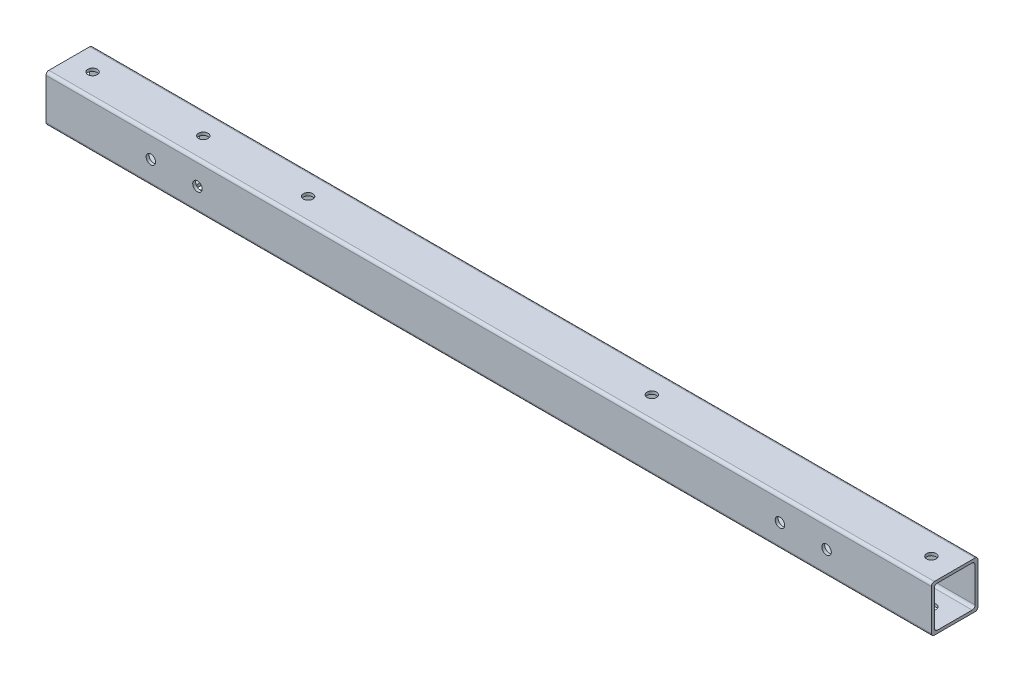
ISO-10303-21;
HEADER;
FILE_DESCRIPTION(('STEP AP214'),'2;1');
FILE_NAME('part.step','',(''),(''),'','','');
FILE_SCHEMA(('AUTOMOTIVE_DESIGN { 1 0 10303 214 1 1 1 1 }'));
ENDSEC;
DATA;
#1=APPLICATION_CONTEXT('core data for automotive mechanical design processes');
#2=APPLICATION_PROTOCOL_DEFINITION('international standard','automotive_design',2000,#1);
#3=PRODUCT_CONTEXT('',#1,'mechanical');
#4=PRODUCT('Part','Part','',(#3));
#5=PRODUCT_RELATED_PRODUCT_CATEGORY('part','',(#4));
#6=PRODUCT_DEFINITION_FORMATION('','',#4);
#7=PRODUCT_DEFINITION_CONTEXT('part definition',#1,'design');
#8=PRODUCT_DEFINITION('design','',#6,#7);
#9=PRODUCT_DEFINITION_SHAPE('','',#8);
#10=(LENGTH_UNIT() NAMED_UNIT(*) SI_UNIT(.MILLI.,.METRE.));
#11=(NAMED_UNIT(*) PLANE_ANGLE_UNIT() SI_UNIT($,.RADIAN.));
#12=(NAMED_UNIT(*) SI_UNIT($,.STERADIAN.) SOLID_ANGLE_UNIT());
#13=UNCERTAINTY_MEASURE_WITH_UNIT(LENGTH_MEASURE(1.E-05),#10,'distance_accuracy_value','');
#14=(GEOMETRIC_REPRESENTATION_CONTEXT(3) GLOBAL_UNCERTAINTY_ASSIGNED_CONTEXT((#13)) GLOBAL_UNIT_ASSIGNED_CONTEXT((#10,
#11,#12)) REPRESENTATION_CONTEXT('',''));
#15=CARTESIAN_POINT('',(0.,0.,0.));
#16=DIRECTION('',(0.,0.,1.));
#17=DIRECTION('',(1.,0.,0.));
#18=AXIS2_PLACEMENT_3D('',#15,#16,#17);
#19=CARTESIAN_POINT('',(0.,101.6,0.));
#20=DIRECTION('',(0.,0.,1.));
#21=DIRECTION('',(1.,0.,0.));
#22=AXIS2_PLACEMENT_3D('',#19,#20,#21);
#23=PLANE('',#22);
#24=CARTESIAN_POINT('',(-228.6,50.7999999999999,2.08403509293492E-13));
#25=DIRECTION('',(0.,0.,1.));
#26=DIRECTION('',(1.,0.,0.));
#27=AXIS2_PLACEMENT_3D('',#24,#25,#26);
#28=CIRCLE('',#27,10.31875);
#29=CARTESIAN_POINT('',(-218.28125,50.7999999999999,2.09667149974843E-13));
#30=VERTEX_POINT('',#29);
#31=EDGE_CURVE('E250',#30,#30,#28,.T.);
#32=ORIENTED_EDGE('',*,*,#31,.T.);
#33=EDGE_LOOP('',(#32));
#34=FACE_BOUND('',#33,.T.);
#35=CARTESIAN_POINT('',(-1600.2,50.7999999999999,1.95961508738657E-13));
#36=DIRECTION('',(0.,0.,-1.));
#37=DIRECTION('',(-1.,0.,0.));
#38=AXIS2_PLACEMENT_3D('',#35,#36,#37);
#39=CIRCLE('',#38,10.31875);
#40=CARTESIAN_POINT('',(-1610.51875,50.7999999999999,1.97225149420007E-13));
#41=VERTEX_POINT('',#40);
#42=EDGE_CURVE('E264',#41,#41,#39,.T.);
#43=ORIENTED_EDGE('',*,*,#42,.F.);
#44=EDGE_LOOP('',(#43));
#45=FACE_BOUND('',#44,.T.);
#46=CARTESIAN_POINT('',(-1701.8,50.7999999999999,2.08403509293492E-13));
#47=DIRECTION('',(0.,0.,-1.));
#48=DIRECTION('',(-1.,0.,0.));
#49=AXIS2_PLACEMENT_3D('',#46,#47,#48);
#50=CIRCLE('',#49,10.31875);
#51=CARTESIAN_POINT('',(-1712.11875,50.7999999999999,2.09667149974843E-13));
#52=VERTEX_POINT('',#51);
#53=EDGE_CURVE('E271',#52,#52,#50,.T.);
#54=ORIENTED_EDGE('',*,*,#53,.F.);
#55=EDGE_LOOP('',(#54));
#56=FACE_BOUND('',#55,.T.);
#57=DIRECTION('',(0.,-1.,0.));
#58=VECTOR('',#57,1.);
#59=CARTESIAN_POINT('',(-1930.4,101.6,2.36398010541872E-13));
#60=LINE('',#59,#58);
#61=CARTESIAN_POINT('',(-1930.4,95.25,2.36398010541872E-13));
#62=VERTEX_POINT('',#61);
#63=CARTESIAN_POINT('',(-1930.4,6.34999999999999,2.36398010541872E-13));
#64=VERTEX_POINT('',#63);
#65=EDGE_CURVE('E322',#62,#64,#60,.T.);
#66=ORIENTED_EDGE('',*,*,#65,.F.);
#67=DIRECTION('',(-1.,0.,0.));
#68=VECTOR('',#67,1.);
#69=CARTESIAN_POINT('',(0.,95.25,0.));
#70=LINE('',#69,#68);
#71=CARTESIAN_POINT('',(0.,95.25,0.));
#72=VERTEX_POINT('',#71);
#73=EDGE_CURVE('E373',#62,#72,#70,.F.);
#74=ORIENTED_EDGE('',*,*,#73,.T.);
#75=DIRECTION('',(0.,-1.,0.));
#76=VECTOR('',#75,1.);
#77=CARTESIAN_POINT('',(0.,101.6,0.));
#78=LINE('',#77,#76);
#79=CARTESIAN_POINT('',(0.,6.34999999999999,0.));
#80=VERTEX_POINT('',#79);
#81=EDGE_CURVE('E160',#72,#80,#78,.T.);
#82=ORIENTED_EDGE('',*,*,#81,.T.);
#83=DIRECTION('',(-1.,0.,0.));
#84=VECTOR('',#83,1.);
#85=CARTESIAN_POINT('',(-1930.4,6.34999999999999,2.36398010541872E-13));
#86=LINE('',#85,#84);
#87=EDGE_CURVE('E371',#80,#64,#86,.T.);
#88=ORIENTED_EDGE('',*,*,#87,.T.);
#89=EDGE_LOOP('',(#66,#74,#82,#88));
#90=FACE_BOUND('',#89,.T.);
#91=CARTESIAN_POINT('',(-330.2,50.7999999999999,1.95961508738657E-13));
#92=DIRECTION('',(0.,0.,1.));
#93=DIRECTION('',(1.,0.,0.));
#94=AXIS2_PLACEMENT_3D('',#91,#92,#93);
#95=CIRCLE('',#94,10.31875);
#96=CARTESIAN_POINT('',(-319.88125,50.7999999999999,1.97225149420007E-13));
#97=VERTEX_POINT('',#96);
#98=EDGE_CURVE('E243',#97,#97,#95,.T.);
#99=ORIENTED_EDGE('',*,*,#98,.T.);
#100=EDGE_LOOP('',(#99));
#101=FACE_BOUND('',#100,.T.);
#102=ADVANCED_FACE('F31',(#34,#45,#56,#90,#101),#23,.F.);
#103=CARTESIAN_POINT('',(0.,101.6,101.6));
#104=DIRECTION('',(0.,0.,-1.));
#105=DIRECTION('',(-1.,0.,0.));
#106=AXIS2_PLACEMENT_3D('',#103,#104,#105);
#107=PLANE('',#106);
#108=CARTESIAN_POINT('',(-228.6,50.7999999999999,101.6));
#109=DIRECTION('',(0.,0.,1.));
#110=DIRECTION('',(1.,0.,0.));
#111=AXIS2_PLACEMENT_3D('',#108,#109,#110);
#112=CIRCLE('',#111,10.31875);
#113=CARTESIAN_POINT('',(-218.28125,50.7999999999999,101.6));
#114=VERTEX_POINT('',#113);
#115=EDGE_CURVE('E207',#114,#114,#112,.T.);
#116=ORIENTED_EDGE('',*,*,#115,.F.);
#117=EDGE_LOOP('',(#116));
#118=FACE_BOUND('',#117,.T.);
#119=CARTESIAN_POINT('',(-1600.2,50.7999999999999,101.6));
#120=DIRECTION('',(0.,0.,-1.));
#121=DIRECTION('',(-1.,0.,0.));
#122=AXIS2_PLACEMENT_3D('',#119,#120,#121);
#123=CIRCLE('',#122,10.31875);
#124=CARTESIAN_POINT('',(-1610.51875,50.7999999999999,101.6));
#125=VERTEX_POINT('',#124);
#126=EDGE_CURVE('E197',#125,#125,#123,.T.);
#127=ORIENTED_EDGE('',*,*,#126,.T.);
#128=EDGE_LOOP('',(#127));
#129=FACE_BOUND('',#128,.T.);
#130=CARTESIAN_POINT('',(-1701.8,50.7999999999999,101.6));
#131=DIRECTION('',(0.,0.,-1.));
#132=DIRECTION('',(-1.,0.,0.));
#133=AXIS2_PLACEMENT_3D('',#130,#131,#132);
#134=CIRCLE('',#133,10.31875);
#135=CARTESIAN_POINT('',(-1712.11875,50.7999999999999,101.6));
#136=VERTEX_POINT('',#135);
#137=EDGE_CURVE('E192',#136,#136,#134,.T.);
#138=ORIENTED_EDGE('',*,*,#137,.T.);
#139=EDGE_LOOP('',(#138));
#140=FACE_BOUND('',#139,.T.);
#141=DIRECTION('',(0.,-1.,0.));
#142=VECTOR('',#141,1.);
#143=CARTESIAN_POINT('',(-1930.4,101.6,101.6));
#144=LINE('',#143,#142);
#145=CARTESIAN_POINT('',(-1930.4,95.25,101.6));
#146=VERTEX_POINT('',#145);
#147=CARTESIAN_POINT('',(-1930.4,6.34999999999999,101.6));
#148=VERTEX_POINT('',#147);
#149=EDGE_CURVE('E319',#146,#148,#144,.T.);
#150=ORIENTED_EDGE('',*,*,#149,.T.);
#151=DIRECTION('',(1.,0.,0.));
#152=VECTOR('',#151,1.);
#153=CARTESIAN_POINT('',(0.,6.34999999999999,101.6));
#154=LINE('',#153,#152);
#155=CARTESIAN_POINT('',(0.,6.34999999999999,101.6));
#156=VERTEX_POINT('',#155);
#157=EDGE_CURVE('E336',#148,#156,#154,.T.);
#158=ORIENTED_EDGE('',*,*,#157,.T.);
#159=DIRECTION('',(0.,-1.,0.));
#160=VECTOR('',#159,1.);
#161=CARTESIAN_POINT('',(0.,101.6,101.6));
#162=LINE('',#161,#160);
#163=CARTESIAN_POINT('',(0.,95.25,101.6));
#164=VERTEX_POINT('',#163);
#165=EDGE_CURVE('E312',#164,#156,#162,.T.);
#166=ORIENTED_EDGE('',*,*,#165,.F.);
#167=DIRECTION('',(1.,0.,0.));
#168=VECTOR('',#167,1.);
#169=CARTESIAN_POINT('',(0.,95.25,101.6));
#170=LINE('',#169,#168);
#171=EDGE_CURVE('E334',#164,#146,#170,.F.);
#172=ORIENTED_EDGE('',*,*,#171,.T.);
#173=EDGE_LOOP('',(#150,#158,#166,#172));
#174=FACE_BOUND('',#173,.T.);
#175=CARTESIAN_POINT('',(-330.2,50.7999999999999,101.6));
#176=DIRECTION('',(0.,0.,1.));
#177=DIRECTION('',(1.,0.,0.));
#178=AXIS2_PLACEMENT_3D('',#175,#176,#177);
#179=CIRCLE('',#178,10.31875);
#180=CARTESIAN_POINT('',(-319.88125,50.7999999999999,101.6));
#181=VERTEX_POINT('',#180);
#182=EDGE_CURVE('E212',#181,#181,#179,.T.);
#183=ORIENTED_EDGE('',*,*,#182,.F.);
#184=EDGE_LOOP('',(#183));
#185=FACE_BOUND('',#184,.T.);
#186=ADVANCED_FACE('F402',(#118,#129,#140,#174,#185),#107,.F.);
#187=CARTESIAN_POINT('',(0.000999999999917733,95.25,6.35000000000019));
#188=DIRECTION('',(0.,0.,-1.));
#189=DIRECTION('',(0.,1.,0.));
#190=AXIS2_PLACEMENT_3D('',#187,#188,#189);
#191=PLANE('',#190);
#192=CARTESIAN_POINT('',(-228.6,50.7999999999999,6.3500000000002));
#193=DIRECTION('',(0.,0.,-1.));
#194=DIRECTION('',(0.,1.,0.));
#195=AXIS2_PLACEMENT_3D('',#192,#193,#194);
#196=CIRCLE('',#195,10.31875);
#197=CARTESIAN_POINT('',(-228.6,61.11875,6.3500000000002));
#198=VERTEX_POINT('',#197);
#199=EDGE_CURVE('E206',#198,#198,#196,.F.);
#200=ORIENTED_EDGE('',*,*,#199,.F.);
#201=EDGE_LOOP('',(#200));
#202=FACE_BOUND('',#201,.T.);
#203=CARTESIAN_POINT('',(-1600.2,50.7999999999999,6.3500000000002));
#204=DIRECTION('',(0.,0.,-1.));
#205=DIRECTION('',(0.,1.,0.));
#206=AXIS2_PLACEMENT_3D('',#203,#204,#205);
#207=CIRCLE('',#206,10.31875);
#208=CARTESIAN_POINT('',(-1600.2,61.11875,6.3500000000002));
#209=VERTEX_POINT('',#208);
#210=EDGE_CURVE('E196',#209,#209,#207,.T.);
#211=ORIENTED_EDGE('',*,*,#210,.T.);
#212=EDGE_LOOP('',(#211));
#213=FACE_BOUND('',#212,.T.);
#214=CARTESIAN_POINT('',(-1701.8,50.7999999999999,6.3500000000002));
#215=DIRECTION('',(0.,0.,-1.));
#216=DIRECTION('',(0.,1.,0.));
#217=AXIS2_PLACEMENT_3D('',#214,#215,#216);
#218=CIRCLE('',#217,10.31875);
#219=CARTESIAN_POINT('',(-1701.8,61.11875,6.3500000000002));
#220=VERTEX_POINT('',#219);
#221=EDGE_CURVE('E191',#220,#220,#218,.T.);
#222=ORIENTED_EDGE('',*,*,#221,.T.);
#223=EDGE_LOOP('',(#222));
#224=FACE_BOUND('',#223,.T.);
#225=DIRECTION('',(0.,1.,0.));
#226=VECTOR('',#225,1.);
#227=CARTESIAN_POINT('',(0.,95.25,6.35000000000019));
#228=LINE('',#227,#226);
#229=CARTESIAN_POINT('',(0.,12.7,6.3500000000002));
#230=VERTEX_POINT('',#229);
#231=CARTESIAN_POINT('',(0.,88.9,6.35000000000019));
#232=VERTEX_POINT('',#231);
#233=EDGE_CURVE('E288',#230,#232,#228,.T.);
#234=ORIENTED_EDGE('',*,*,#233,.T.);
#235=DIRECTION('',(-1.,0.,0.));
#236=VECTOR('',#235,1.);
#237=CARTESIAN_POINT('',(-1930.4,88.9,6.35000000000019));
#238=LINE('',#237,#236);
#239=CARTESIAN_POINT('',(-1930.4,88.9,6.35000000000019));
#240=VERTEX_POINT('',#239);
#241=EDGE_CURVE('E368',#232,#240,#238,.T.);
#242=ORIENTED_EDGE('',*,*,#241,.T.);
#243=DIRECTION('',(0.,-1.,0.));
#244=VECTOR('',#243,1.);
#245=CARTESIAN_POINT('',(-1930.4,95.25,6.35000000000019));
#246=LINE('',#245,#244);
#247=CARTESIAN_POINT('',(-1930.4,12.7,6.3500000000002));
#248=VERTEX_POINT('',#247);
#249=EDGE_CURVE('E291',#240,#248,#246,.T.);
#250=ORIENTED_EDGE('',*,*,#249,.T.);
#251=DIRECTION('',(-1.,0.,0.));
#252=VECTOR('',#251,1.);
#253=CARTESIAN_POINT('',(0.,12.7,6.3500000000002));
#254=LINE('',#253,#252);
#255=EDGE_CURVE('E366',#248,#230,#254,.F.);
#256=ORIENTED_EDGE('',*,*,#255,.T.);
#257=EDGE_LOOP('',(#234,#242,#250,#256));
#258=FACE_BOUND('',#257,.T.);
#259=CARTESIAN_POINT('',(-330.2,50.7999999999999,6.3500000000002));
#260=DIRECTION('',(0.,0.,-1.));
#261=DIRECTION('',(0.,1.,0.));
#262=AXIS2_PLACEMENT_3D('',#259,#260,#261);
#263=CIRCLE('',#262,10.31875);
#264=CARTESIAN_POINT('',(-330.2,61.11875,6.3500000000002));
#265=VERTEX_POINT('',#264);
#266=EDGE_CURVE('E211',#265,#265,#263,.F.);
#267=ORIENTED_EDGE('',*,*,#266,.F.);
#268=EDGE_LOOP('',(#267));
#269=FACE_BOUND('',#268,.T.);
#270=ADVANCED_FACE('F408',(#202,#213,#224,#258,#269),#191,.F.);
#271=CARTESIAN_POINT('',(0.000999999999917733,95.25,95.2500000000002));
#272=DIRECTION('',(0.,0.,1.));
#273=DIRECTION('',(0.,-1.,0.));
#274=AXIS2_PLACEMENT_3D('',#271,#272,#273);
#275=PLANE('',#274);
#276=CARTESIAN_POINT('',(-228.6,50.7999999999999,95.2500000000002));
#277=DIRECTION('',(0.,0.,1.));
#278=DIRECTION('',(0.,-1.,0.));
#279=AXIS2_PLACEMENT_3D('',#276,#277,#278);
#280=CIRCLE('',#279,10.31875);
#281=CARTESIAN_POINT('',(-228.6,40.4812499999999,95.2500000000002));
#282=VERTEX_POINT('',#281);
#283=EDGE_CURVE('E203',#282,#282,#280,.F.);
#284=ORIENTED_EDGE('',*,*,#283,.F.);
#285=EDGE_LOOP('',(#284));
#286=FACE_BOUND('',#285,.T.);
#287=CARTESIAN_POINT('',(-1600.2,50.7999999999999,95.2500000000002));
#288=DIRECTION('',(0.,0.,1.));
#289=DIRECTION('',(0.,-1.,0.));
#290=AXIS2_PLACEMENT_3D('',#287,#288,#289);
#291=CIRCLE('',#290,10.31875);
#292=CARTESIAN_POINT('',(-1600.2,40.4812499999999,95.2500000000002));
#293=VERTEX_POINT('',#292);
#294=EDGE_CURVE('E193',#293,#293,#291,.T.);
#295=ORIENTED_EDGE('',*,*,#294,.T.);
#296=EDGE_LOOP('',(#295));
#297=FACE_BOUND('',#296,.T.);
#298=CARTESIAN_POINT('',(-1701.8,50.7999999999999,95.2500000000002));
#299=DIRECTION('',(0.,0.,1.));
#300=DIRECTION('',(0.,-1.,0.));
#301=AXIS2_PLACEMENT_3D('',#298,#299,#300);
#302=CIRCLE('',#301,10.31875);
#303=CARTESIAN_POINT('',(-1701.8,40.4812499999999,95.2500000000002));
#304=VERTEX_POINT('',#303);
#305=EDGE_CURVE('E188',#304,#304,#302,.T.);
#306=ORIENTED_EDGE('',*,*,#305,.T.);
#307=EDGE_LOOP('',(#306));
#308=FACE_BOUND('',#307,.T.);
#309=DIRECTION('',(0.,-1.,0.));
#310=VECTOR('',#309,1.);
#311=CARTESIAN_POINT('',(0.,95.25,95.2500000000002));
#312=LINE('',#311,#310);
#313=CARTESIAN_POINT('',(0.,88.9,95.2500000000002));
#314=VERTEX_POINT('',#313);
#315=CARTESIAN_POINT('',(0.,12.7,95.2500000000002));
#316=VERTEX_POINT('',#315);
#317=EDGE_CURVE('E153',#314,#316,#312,.T.);
#318=ORIENTED_EDGE('',*,*,#317,.T.);
#319=DIRECTION('',(-1.,0.,0.));
#320=VECTOR('',#319,1.);
#321=CARTESIAN_POINT('',(-1930.4,12.7,95.2500000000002));
#322=LINE('',#321,#320);
#323=CARTESIAN_POINT('',(-1930.4,12.7,95.2500000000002));
#324=VERTEX_POINT('',#323);
#325=EDGE_CURVE('E159',#316,#324,#322,.T.);
#326=ORIENTED_EDGE('',*,*,#325,.T.);
#327=DIRECTION('',(0.,1.,0.));
#328=VECTOR('',#327,1.);
#329=CARTESIAN_POINT('',(-1930.4,95.25,95.2500000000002));
#330=LINE('',#329,#328);
#331=CARTESIAN_POINT('',(-1930.4,88.9,95.2500000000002));
#332=VERTEX_POINT('',#331);
#333=EDGE_CURVE('E156',#324,#332,#330,.T.);
#334=ORIENTED_EDGE('',*,*,#333,.T.);
#335=DIRECTION('',(-1.,0.,0.));
#336=VECTOR('',#335,1.);
#337=CARTESIAN_POINT('',(0.,88.9,95.2500000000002));
#338=LINE('',#337,#336);
#339=EDGE_CURVE('E148',#332,#314,#338,.F.);
#340=ORIENTED_EDGE('',*,*,#339,.T.);
#341=EDGE_LOOP('',(#318,#326,#334,#340));
#342=FACE_BOUND('',#341,.T.);
#343=CARTESIAN_POINT('',(-330.2,50.7999999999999,95.2500000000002));
#344=DIRECTION('',(0.,0.,1.));
#345=DIRECTION('',(0.,-1.,0.));
#346=AXIS2_PLACEMENT_3D('',#343,#344,#345);
#347=CIRCLE('',#346,10.31875);
#348=CARTESIAN_POINT('',(-330.2,40.4812499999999,95.2500000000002));
#349=VERTEX_POINT('',#348);
#350=EDGE_CURVE('E208',#349,#349,#347,.F.);
#351=ORIENTED_EDGE('',*,*,#350,.F.);
#352=EDGE_LOOP('',(#351));
#353=FACE_BOUND('',#352,.T.);
#354=ADVANCED_FACE('F150',(#286,#297,#308,#342,#353),#275,.F.);
#355=CARTESIAN_POINT('',(0.,101.6,0.));
#356=DIRECTION('',(0.,-1.,0.));
#357=DIRECTION('',(0.,0.,-1.));
#358=AXIS2_PLACEMENT_3D('',#355,#356,#357);
#359=PLANE('',#358);
#360=CARTESIAN_POINT('',(-1638.3,101.6,50.8));
#361=DIRECTION('',(0.,1.,0.));
#362=DIRECTION('',(0.,0.,1.));
#363=AXIS2_PLACEMENT_3D('',#360,#361,#362);
#364=CIRCLE('',#363,10.31875);
#365=CARTESIAN_POINT('',(-1638.3,101.6,61.11875));
#366=VERTEX_POINT('',#365);
#367=EDGE_CURVE('E528',#366,#366,#364,.T.);
#368=ORIENTED_EDGE('',*,*,#367,.F.);
#369=EDGE_LOOP('',(#368));
#370=FACE_BOUND('',#369,.T.);
#371=CARTESIAN_POINT('',(-1409.7,101.6,50.8000000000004));
#372=DIRECTION('',(0.,1.,0.));
#373=DIRECTION('',(0.,0.,1.));
#374=AXIS2_PLACEMENT_3D('',#371,#372,#373);
#375=CIRCLE('',#374,10.31875);
#376=CARTESIAN_POINT('',(-1409.7,101.6,61.1187500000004));
#377=VERTEX_POINT('',#376);
#378=EDGE_CURVE('E227',#377,#377,#375,.T.);
#379=ORIENTED_EDGE('',*,*,#378,.F.);
#380=EDGE_LOOP('',(#379));
#381=FACE_BOUND('',#380,.T.);
#382=CARTESIAN_POINT('',(-660.4,101.6,50.8000000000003));
#383=DIRECTION('',(0.,1.,0.));
#384=DIRECTION('',(0.,0.,1.));
#385=AXIS2_PLACEMENT_3D('',#382,#383,#384);
#386=CIRCLE('',#385,10.31875);
#387=CARTESIAN_POINT('',(-660.4,101.6,61.1187500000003));
#388=VERTEX_POINT('',#387);
#389=EDGE_CURVE('E224',#388,#388,#386,.T.);
#390=ORIENTED_EDGE('',*,*,#389,.F.);
#391=EDGE_LOOP('',(#390));
#392=FACE_BOUND('',#391,.T.);
#393=DIRECTION('',(0.,0.,1.));
#394=VECTOR('',#393,1.);
#395=CARTESIAN_POINT('',(-1930.4,101.6,2.36398010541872E-13));
#396=LINE('',#395,#394);
#397=CARTESIAN_POINT('',(-1930.4,101.6,6.35000000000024));
#398=VERTEX_POINT('',#397);
#399=CARTESIAN_POINT('',(-1930.4,101.6,95.2500000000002));
#400=VERTEX_POINT('',#399);
#401=EDGE_CURVE('E308',#398,#400,#396,.T.);
#402=ORIENTED_EDGE('',*,*,#401,.T.);
#403=DIRECTION('',(1.,0.,0.));
#404=VECTOR('',#403,1.);
#405=CARTESIAN_POINT('',(0.,101.6,95.25));
#406=LINE('',#405,#404);
#407=CARTESIAN_POINT('',(0.,101.6,95.25));
#408=VERTEX_POINT('',#407);
#409=EDGE_CURVE('E360',#400,#408,#406,.T.);
#410=ORIENTED_EDGE('',*,*,#409,.T.);
#411=DIRECTION('',(0.,0.,-1.));
#412=VECTOR('',#411,1.);
#413=CARTESIAN_POINT('',(0.,101.6,0.));
#414=LINE('',#413,#412);
#415=CARTESIAN_POINT('',(0.,101.6,6.35));
#416=VERTEX_POINT('',#415);
#417=EDGE_CURVE('E305',#408,#416,#414,.T.);
#418=ORIENTED_EDGE('',*,*,#417,.T.);
#419=DIRECTION('',(-1.,0.,0.));
#420=VECTOR('',#419,1.);
#421=CARTESIAN_POINT('',(0.,101.6,6.35));
#422=LINE('',#421,#420);
#423=EDGE_CURVE('E357',#416,#398,#422,.T.);
#424=ORIENTED_EDGE('',*,*,#423,.T.);
#425=EDGE_LOOP('',(#402,#410,#418,#424));
#426=FACE_BOUND('',#425,.T.);
#427=CARTESIAN_POINT('',(-1879.6,101.6,50.8000000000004));
#428=DIRECTION('',(0.,1.,0.));
#429=DIRECTION('',(0.,0.,1.));
#430=AXIS2_PLACEMENT_3D('',#427,#428,#429);
#431=CIRCLE('',#430,10.31875);
#432=CARTESIAN_POINT('',(-1879.6,101.6,61.1187500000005));
#433=VERTEX_POINT('',#432);
#434=EDGE_CURVE('E278',#433,#433,#431,.T.);
#435=ORIENTED_EDGE('',*,*,#434,.F.);
#436=EDGE_LOOP('',(#435));
#437=FACE_BOUND('',#436,.T.);
#438=CARTESIAN_POINT('',(-50.8,101.6,50.8000000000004));
#439=DIRECTION('',(0.,-1.,0.));
#440=DIRECTION('',(0.,0.,1.));
#441=AXIS2_PLACEMENT_3D('',#438,#439,#440);
#442=CIRCLE('',#441,10.31875);
#443=CARTESIAN_POINT('',(-50.8,101.6,61.1187500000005));
#444=VERTEX_POINT('',#443);
#445=EDGE_CURVE('E257',#444,#444,#442,.T.);
#446=ORIENTED_EDGE('',*,*,#445,.T.);
#447=EDGE_LOOP('',(#446));
#448=FACE_BOUND('',#447,.T.);
#449=ADVANCED_FACE('F433',(#370,#381,#392,#426,#437,#448),#359,.F.);
#450=CARTESIAN_POINT('',(0.,0.,0.));
#451=DIRECTION('',(0.,-1.,0.));
#452=DIRECTION('',(0.,0.,-1.));
#453=AXIS2_PLACEMENT_3D('',#450,#451,#452);
#454=PLANE('',#453);
#455=CARTESIAN_POINT('',(-1638.3,0.,50.8));
#456=DIRECTION('',(0.,1.,0.));
#457=DIRECTION('',(0.,0.,1.));
#458=AXIS2_PLACEMENT_3D('',#455,#456,#457);
#459=CIRCLE('',#458,10.31875);
#460=CARTESIAN_POINT('',(-1638.3,0.,61.11875));
#461=VERTEX_POINT('',#460);
#462=EDGE_CURVE('E443',#461,#461,#459,.T.);
#463=ORIENTED_EDGE('',*,*,#462,.T.);
#464=EDGE_LOOP('',(#463));
#465=FACE_BOUND('',#464,.T.);
#466=CARTESIAN_POINT('',(-1409.7,0.,50.8000000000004));
#467=DIRECTION('',(0.,1.,0.));
#468=DIRECTION('',(0.,0.,1.));
#469=AXIS2_PLACEMENT_3D('',#466,#467,#468);
#470=CIRCLE('',#469,10.31875);
#471=CARTESIAN_POINT('',(-1409.7,0.,61.1187500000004));
#472=VERTEX_POINT('',#471);
#473=EDGE_CURVE('E220',#472,#472,#470,.T.);
#474=ORIENTED_EDGE('',*,*,#473,.T.);
#475=EDGE_LOOP('',(#474));
#476=FACE_BOUND('',#475,.T.);
#477=CARTESIAN_POINT('',(-660.4,0.,50.8000000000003));
#478=DIRECTION('',(0.,1.,0.));
#479=DIRECTION('',(0.,0.,1.));
#480=AXIS2_PLACEMENT_3D('',#477,#478,#479);
#481=CIRCLE('',#480,10.31875);
#482=CARTESIAN_POINT('',(-660.4,0.,61.1187500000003));
#483=VERTEX_POINT('',#482);
#484=EDGE_CURVE('E216',#483,#483,#481,.T.);
#485=ORIENTED_EDGE('',*,*,#484,.T.);
#486=EDGE_LOOP('',(#485));
#487=FACE_BOUND('',#486,.T.);
#488=DIRECTION('',(0.,0.,-1.));
#489=VECTOR('',#488,1.);
#490=CARTESIAN_POINT('',(0.,0.,0.));
#491=LINE('',#490,#489);
#492=CARTESIAN_POINT('',(0.,0.,95.25));
#493=VERTEX_POINT('',#492);
#494=CARTESIAN_POINT('',(0.,0.,6.35));
#495=VERTEX_POINT('',#494);
#496=EDGE_CURVE('E304',#493,#495,#491,.T.);
#497=ORIENTED_EDGE('',*,*,#496,.F.);
#498=DIRECTION('',(1.,0.,0.));
#499=VECTOR('',#498,1.);
#500=CARTESIAN_POINT('',(-1930.4,0.,95.2500000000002));
#501=LINE('',#500,#499);
#502=CARTESIAN_POINT('',(-1930.4,0.,95.2500000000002));
#503=VERTEX_POINT('',#502);
#504=EDGE_CURVE('E349',#493,#503,#501,.F.);
#505=ORIENTED_EDGE('',*,*,#504,.T.);
#506=DIRECTION('',(0.,0.,1.));
#507=VECTOR('',#506,1.);
#508=CARTESIAN_POINT('',(-1930.4,0.,2.36398010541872E-13));
#509=LINE('',#508,#507);
#510=CARTESIAN_POINT('',(-1930.4,0.,6.35000000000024));
#511=VERTEX_POINT('',#510);
#512=EDGE_CURVE('E309',#511,#503,#509,.T.);
#513=ORIENTED_EDGE('',*,*,#512,.F.);
#514=DIRECTION('',(-1.,0.,0.));
#515=VECTOR('',#514,1.);
#516=CARTESIAN_POINT('',(0.,0.,6.35));
#517=LINE('',#516,#515);
#518=EDGE_CURVE('E347',#511,#495,#517,.F.);
#519=ORIENTED_EDGE('',*,*,#518,.T.);
#520=EDGE_LOOP('',(#497,#505,#513,#519));
#521=FACE_BOUND('',#520,.T.);
#522=CARTESIAN_POINT('',(-1879.6,0.,50.8000000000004));
#523=DIRECTION('',(0.,1.,0.));
#524=DIRECTION('',(0.,0.,1.));
#525=AXIS2_PLACEMENT_3D('',#522,#523,#524);
#526=CIRCLE('',#525,10.31875);
#527=CARTESIAN_POINT('',(-1879.6,0.,61.1187500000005));
#528=VERTEX_POINT('',#527);
#529=EDGE_CURVE('E279',#528,#528,#526,.T.);
#530=ORIENTED_EDGE('',*,*,#529,.T.);
#531=EDGE_LOOP('',(#530));
#532=FACE_BOUND('',#531,.T.);
#533=CARTESIAN_POINT('',(-50.8,0.,50.8000000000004));
#534=DIRECTION('',(0.,-1.,0.));
#535=DIRECTION('',(0.,0.,1.));
#536=AXIS2_PLACEMENT_3D('',#533,#534,#535);
#537=CIRCLE('',#536,10.31875);
#538=CARTESIAN_POINT('',(-50.8,0.,61.1187500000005));
#539=VERTEX_POINT('',#538);
#540=EDGE_CURVE('E202',#539,#539,#537,.T.);
#541=ORIENTED_EDGE('',*,*,#540,.F.);
#542=EDGE_LOOP('',(#541));
#543=FACE_BOUND('',#542,.T.);
#544=ADVANCED_FACE('F424',(#465,#476,#487,#521,#532,#543),#454,.T.);
#545=CARTESIAN_POINT('',(0.000999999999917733,95.25,6.35000000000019));
#546=DIRECTION('',(0.,1.,0.));
#547=DIRECTION('',(0.,0.,1.));
#548=AXIS2_PLACEMENT_3D('',#545,#546,#547);
#549=PLANE('',#548);
#550=CARTESIAN_POINT('',(-1638.3,95.25,50.8));
#551=DIRECTION('',(0.,1.,0.));
#552=DIRECTION('',(0.,0.,1.));
#553=AXIS2_PLACEMENT_3D('',#550,#551,#552);
#554=CIRCLE('',#553,10.31875);
#555=CARTESIAN_POINT('',(-1638.3,95.25,61.11875));
#556=VERTEX_POINT('',#555);
#557=EDGE_CURVE('E232',#556,#556,#554,.T.);
#558=ORIENTED_EDGE('',*,*,#557,.T.);
#559=EDGE_LOOP('',(#558));
#560=FACE_BOUND('',#559,.T.);
#561=CARTESIAN_POINT('',(-1409.7,95.25,50.8000000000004));
#562=DIRECTION('',(0.,1.,0.));
#563=DIRECTION('',(0.,0.,1.));
#564=AXIS2_PLACEMENT_3D('',#561,#562,#563);
#565=CIRCLE('',#564,10.31875);
#566=CARTESIAN_POINT('',(-1409.7,95.25,61.1187500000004));
#567=VERTEX_POINT('',#566);
#568=EDGE_CURVE('E219',#567,#567,#565,.T.);
#569=ORIENTED_EDGE('',*,*,#568,.T.);
#570=EDGE_LOOP('',(#569));
#571=FACE_BOUND('',#570,.T.);
#572=CARTESIAN_POINT('',(-660.4,95.25,50.8000000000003));
#573=DIRECTION('',(0.,1.,0.));
#574=DIRECTION('',(0.,0.,1.));
#575=AXIS2_PLACEMENT_3D('',#572,#573,#574);
#576=CIRCLE('',#575,10.31875);
#577=CARTESIAN_POINT('',(-660.4,95.25,61.1187500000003));
#578=VERTEX_POINT('',#577);
#579=EDGE_CURVE('E215',#578,#578,#576,.T.);
#580=ORIENTED_EDGE('',*,*,#579,.T.);
#581=EDGE_LOOP('',(#580));
#582=FACE_BOUND('',#581,.T.);
#583=DIRECTION('',(0.,0.,1.));
#584=VECTOR('',#583,1.);
#585=CARTESIAN_POINT('',(0.,95.25,6.35000000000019));
#586=LINE('',#585,#584);
#587=CARTESIAN_POINT('',(0.,95.25,12.7000000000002));
#588=VERTEX_POINT('',#587);
#589=CARTESIAN_POINT('',(0.,95.25,88.9000000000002));
#590=VERTEX_POINT('',#589);
#591=EDGE_CURVE('E171',#588,#590,#586,.T.);
#592=ORIENTED_EDGE('',*,*,#591,.T.);
#593=DIRECTION('',(-1.,0.,0.));
#594=VECTOR('',#593,1.);
#595=CARTESIAN_POINT('',(-1930.4,95.25,88.9000000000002));
#596=LINE('',#595,#594);
#597=CARTESIAN_POINT('',(-1930.4,95.25,88.9000000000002));
#598=VERTEX_POINT('',#597);
#599=EDGE_CURVE('E177',#590,#598,#596,.T.);
#600=ORIENTED_EDGE('',*,*,#599,.T.);
#601=DIRECTION('',(0.,0.,-1.));
#602=VECTOR('',#601,1.);
#603=CARTESIAN_POINT('',(-1930.4,95.25,6.35000000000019));
#604=LINE('',#603,#602);
#605=CARTESIAN_POINT('',(-1930.4,95.25,12.7000000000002));
#606=VERTEX_POINT('',#605);
#607=EDGE_CURVE('E298',#598,#606,#604,.T.);
#608=ORIENTED_EDGE('',*,*,#607,.T.);
#609=DIRECTION('',(-1.,0.,0.));
#610=VECTOR('',#609,1.);
#611=CARTESIAN_POINT('',(0.,95.25,12.7000000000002));
#612=LINE('',#611,#610);
#613=EDGE_CURVE('E363',#606,#588,#612,.F.);
#614=ORIENTED_EDGE('',*,*,#613,.T.);
#615=EDGE_LOOP('',(#592,#600,#608,#614));
#616=FACE_BOUND('',#615,.T.);
#617=CARTESIAN_POINT('',(-1879.6,95.25,50.8000000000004));
#618=DIRECTION('',(0.,1.,0.));
#619=DIRECTION('',(0.,0.,1.));
#620=AXIS2_PLACEMENT_3D('',#617,#618,#619);
#621=CIRCLE('',#620,10.31875);
#622=CARTESIAN_POINT('',(-1879.6,95.25,61.1187500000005));
#623=VERTEX_POINT('',#622);
#624=EDGE_CURVE('E172',#623,#623,#621,.T.);
#625=ORIENTED_EDGE('',*,*,#624,.T.);
#626=EDGE_LOOP('',(#625));
#627=FACE_BOUND('',#626,.T.);
#628=CARTESIAN_POINT('',(-50.8,95.25,50.8000000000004));
#629=DIRECTION('',(0.,1.,0.));
#630=DIRECTION('',(0.,0.,1.));
#631=AXIS2_PLACEMENT_3D('',#628,#629,#630);
#632=CIRCLE('',#631,10.31875);
#633=CARTESIAN_POINT('',(-50.8,95.25,61.1187500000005));
#634=VERTEX_POINT('',#633);
#635=EDGE_CURVE('E201',#634,#634,#632,.F.);
#636=ORIENTED_EDGE('',*,*,#635,.F.);
#637=EDGE_LOOP('',(#636));
#638=FACE_BOUND('',#637,.T.);
#639=ADVANCED_FACE('F418',(#560,#571,#582,#616,#627,#638),#549,.F.);
#640=CARTESIAN_POINT('',(0.000999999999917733,6.35,6.35000000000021));
#641=DIRECTION('',(0.,-1.,0.));
#642=DIRECTION('',(0.,0.,-1.));
#643=AXIS2_PLACEMENT_3D('',#640,#641,#642);
#644=PLANE('',#643);
#645=CARTESIAN_POINT('',(-1638.3,6.35,50.8));
#646=DIRECTION('',(0.,-1.,0.));
#647=DIRECTION('',(0.,0.,-1.));
#648=AXIS2_PLACEMENT_3D('',#645,#646,#647);
#649=CIRCLE('',#648,10.31875);
#650=CARTESIAN_POINT('',(-1638.3,6.35,40.48125));
#651=VERTEX_POINT('',#650);
#652=EDGE_CURVE('E35',#651,#651,#649,.T.);
#653=ORIENTED_EDGE('',*,*,#652,.T.);
#654=EDGE_LOOP('',(#653));
#655=FACE_BOUND('',#654,.T.);
#656=CARTESIAN_POINT('',(-1409.7,6.35,50.8000000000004));
#657=DIRECTION('',(0.,-1.,0.));
#658=DIRECTION('',(0.,0.,-1.));
#659=AXIS2_PLACEMENT_3D('',#656,#657,#658);
#660=CIRCLE('',#659,10.31875);
#661=CARTESIAN_POINT('',(-1409.7,6.35,40.4812500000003));
#662=VERTEX_POINT('',#661);
#663=EDGE_CURVE('E217',#662,#662,#660,.T.);
#664=ORIENTED_EDGE('',*,*,#663,.T.);
#665=EDGE_LOOP('',(#664));
#666=FACE_BOUND('',#665,.T.);
#667=CARTESIAN_POINT('',(-660.4,6.35,50.8000000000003));
#668=DIRECTION('',(0.,-1.,0.));
#669=DIRECTION('',(0.,0.,-1.));
#670=AXIS2_PLACEMENT_3D('',#667,#668,#669);
#671=CIRCLE('',#670,10.31875);
#672=CARTESIAN_POINT('',(-660.4,6.35,40.4812500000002));
#673=VERTEX_POINT('',#672);
#674=EDGE_CURVE('E213',#673,#673,#671,.T.);
#675=ORIENTED_EDGE('',*,*,#674,.T.);
#676=EDGE_LOOP('',(#675));
#677=FACE_BOUND('',#676,.T.);
#678=DIRECTION('',(0.,0.,1.));
#679=VECTOR('',#678,1.);
#680=CARTESIAN_POINT('',(-1930.4,6.35,6.35000000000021));
#681=LINE('',#680,#679);
#682=CARTESIAN_POINT('',(-1930.4,6.35,12.7000000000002));
#683=VERTEX_POINT('',#682);
#684=CARTESIAN_POINT('',(-1930.4,6.35,88.9000000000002));
#685=VERTEX_POINT('',#684);
#686=EDGE_CURVE('E294',#683,#685,#681,.T.);
#687=ORIENTED_EDGE('',*,*,#686,.T.);
#688=DIRECTION('',(-1.,0.,0.));
#689=VECTOR('',#688,1.);
#690=CARTESIAN_POINT('',(0.,6.35,88.9000000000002));
#691=LINE('',#690,#689);
#692=CARTESIAN_POINT('',(0.,6.35,88.9000000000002));
#693=VERTEX_POINT('',#692);
#694=EDGE_CURVE('E332',#685,#693,#691,.F.);
#695=ORIENTED_EDGE('',*,*,#694,.T.);
#696=DIRECTION('',(0.,0.,-1.));
#697=VECTOR('',#696,1.);
#698=CARTESIAN_POINT('',(0.,6.35,6.35000000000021));
#699=LINE('',#698,#697);
#700=CARTESIAN_POINT('',(0.,6.35,12.7000000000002));
#701=VERTEX_POINT('',#700);
#702=EDGE_CURVE('E301',#693,#701,#699,.T.);
#703=ORIENTED_EDGE('',*,*,#702,.T.);
#704=DIRECTION('',(-1.,0.,0.));
#705=VECTOR('',#704,1.);
#706=CARTESIAN_POINT('',(-1930.4,6.35,12.7000000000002));
#707=LINE('',#706,#705);
#708=EDGE_CURVE('E329',#701,#683,#707,.T.);
#709=ORIENTED_EDGE('',*,*,#708,.T.);
#710=EDGE_LOOP('',(#687,#695,#703,#709));
#711=FACE_BOUND('',#710,.T.);
#712=CARTESIAN_POINT('',(-1879.6,6.35,50.8000000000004));
#713=DIRECTION('',(0.,-1.,0.));
#714=DIRECTION('',(0.,0.,-1.));
#715=AXIS2_PLACEMENT_3D('',#712,#713,#714);
#716=CIRCLE('',#715,10.31875);
#717=CARTESIAN_POINT('',(-1879.6,6.35,40.4812500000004));
#718=VERTEX_POINT('',#717);
#719=EDGE_CURVE('E282',#718,#718,#716,.T.);
#720=ORIENTED_EDGE('',*,*,#719,.T.);
#721=EDGE_LOOP('',(#720));
#722=FACE_BOUND('',#721,.T.);
#723=CARTESIAN_POINT('',(-50.8,6.35,50.8000000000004));
#724=DIRECTION('',(0.,-1.,0.));
#725=DIRECTION('',(0.,0.,-1.));
#726=AXIS2_PLACEMENT_3D('',#723,#724,#725);
#727=CIRCLE('',#726,10.31875);
#728=CARTESIAN_POINT('',(-50.8,6.35,40.4812500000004));
#729=VERTEX_POINT('',#728);
#730=EDGE_CURVE('E198',#729,#729,#727,.F.);
#731=ORIENTED_EDGE('',*,*,#730,.F.);
#732=EDGE_LOOP('',(#731));
#733=FACE_BOUND('',#732,.T.);
#734=ADVANCED_FACE('F382',(#655,#666,#677,#711,#722,#733),#644,.F.);
#735=CARTESIAN_POINT('',(0.,101.6,0.));
#736=DIRECTION('',(-1.,0.,0.));
#737=DIRECTION('',(0.,0.,1.));
#738=AXIS2_PLACEMENT_3D('',#735,#736,#737);
#739=PLANE('',#738);
#740=ORIENTED_EDGE('',*,*,#591,.F.);
#741=CARTESIAN_POINT('',(0.,88.9,12.7000000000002));
#742=DIRECTION('',(-1.,0.,0.));
#743=DIRECTION('',(0.,0.,1.));
#744=AXIS2_PLACEMENT_3D('',#741,#742,#743);
#745=CIRCLE('',#744,6.35);
#746=EDGE_CURVE('E181',#588,#232,#745,.T.);
#747=ORIENTED_EDGE('',*,*,#746,.T.);
#748=ORIENTED_EDGE('',*,*,#233,.F.);
#749=CARTESIAN_POINT('',(0.,12.7,12.7000000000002));
#750=DIRECTION('',(-1.,0.,0.));
#751=DIRECTION('',(0.,0.,1.));
#752=AXIS2_PLACEMENT_3D('',#749,#750,#751);
#753=CIRCLE('',#752,6.35);
#754=EDGE_CURVE('E11',#230,#701,#753,.T.);
#755=ORIENTED_EDGE('',*,*,#754,.T.);
#756=ORIENTED_EDGE('',*,*,#702,.F.);
#757=CARTESIAN_POINT('',(0.,12.7,88.9000000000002));
#758=DIRECTION('',(-1.,0.,0.));
#759=DIRECTION('',(0.,0.,1.));
#760=AXIS2_PLACEMENT_3D('',#757,#758,#759);
#761=CIRCLE('',#760,6.35);
#762=EDGE_CURVE('E170',#693,#316,#761,.T.);
#763=ORIENTED_EDGE('',*,*,#762,.T.);
#764=ORIENTED_EDGE('',*,*,#317,.F.);
#765=CARTESIAN_POINT('',(0.,88.9,88.9000000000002));
#766=DIRECTION('',(-1.,0.,0.));
#767=DIRECTION('',(0.,0.,1.));
#768=AXIS2_PLACEMENT_3D('',#765,#766,#767);
#769=CIRCLE('',#768,6.35);
#770=EDGE_CURVE('E166',#314,#590,#769,.T.);
#771=ORIENTED_EDGE('',*,*,#770,.T.);
#772=EDGE_LOOP('',(#740,#747,#748,#755,#756,#763,#764,#771));
#773=FACE_BOUND('',#772,.T.);
#774=ORIENTED_EDGE('',*,*,#165,.T.);
#775=CARTESIAN_POINT('',(0.,6.34999999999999,95.25));
#776=DIRECTION('',(-1.,0.,0.));
#777=DIRECTION('',(0.,0.,1.));
#778=AXIS2_PLACEMENT_3D('',#775,#776,#777);
#779=CIRCLE('',#778,6.35);
#780=EDGE_CURVE('E345',#156,#493,#779,.F.);
#781=ORIENTED_EDGE('',*,*,#780,.T.);
#782=ORIENTED_EDGE('',*,*,#496,.T.);
#783=CARTESIAN_POINT('',(0.,6.34999999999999,6.35));
#784=DIRECTION('',(-1.,0.,0.));
#785=DIRECTION('',(0.,0.,1.));
#786=AXIS2_PLACEMENT_3D('',#783,#784,#785);
#787=CIRCLE('',#786,6.35);
#788=EDGE_CURVE('E339',#495,#80,#787,.F.);
#789=ORIENTED_EDGE('',*,*,#788,.T.);
#790=ORIENTED_EDGE('',*,*,#81,.F.);
#791=CARTESIAN_POINT('',(0.,95.25,6.35));
#792=DIRECTION('',(-1.,0.,0.));
#793=DIRECTION('',(0.,0.,1.));
#794=AXIS2_PLACEMENT_3D('',#791,#792,#793);
#795=CIRCLE('',#794,6.35);
#796=EDGE_CURVE('E341',#72,#416,#795,.F.);
#797=ORIENTED_EDGE('',*,*,#796,.T.);
#798=ORIENTED_EDGE('',*,*,#417,.F.);
#799=CARTESIAN_POINT('',(0.,95.25,95.25));
#800=DIRECTION('',(-1.,0.,0.));
#801=DIRECTION('',(0.,0.,1.));
#802=AXIS2_PLACEMENT_3D('',#799,#800,#801);
#803=CIRCLE('',#802,6.35);
#804=EDGE_CURVE('E343',#408,#164,#803,.F.);
#805=ORIENTED_EDGE('',*,*,#804,.T.);
#806=EDGE_LOOP('',(#774,#781,#782,#789,#790,#797,#798,#805));
#807=FACE_BOUND('',#806,.T.);
#808=ADVANCED_FACE('F164',(#773,#807),#739,.F.);
#809=CARTESIAN_POINT('',(-1930.4,101.6,2.36398010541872E-13));
#810=DIRECTION('',(1.,0.,0.));
#811=DIRECTION('',(0.,0.,-1.));
#812=AXIS2_PLACEMENT_3D('',#809,#810,#811);
#813=PLANE('',#812);
#814=ORIENTED_EDGE('',*,*,#686,.F.);
#815=CARTESIAN_POINT('',(-1930.4,12.7,12.7000000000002));
#816=DIRECTION('',(1.,0.,0.));
#817=DIRECTION('',(0.,0.,-1.));
#818=AXIS2_PLACEMENT_3D('',#815,#816,#817);
#819=CIRCLE('',#818,6.35);
#820=EDGE_CURVE('E40',#683,#248,#819,.T.);
#821=ORIENTED_EDGE('',*,*,#820,.T.);
#822=ORIENTED_EDGE('',*,*,#249,.F.);
#823=CARTESIAN_POINT('',(-1930.4,88.9,12.7000000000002));
#824=DIRECTION('',(1.,0.,0.));
#825=DIRECTION('',(0.,0.,-1.));
#826=AXIS2_PLACEMENT_3D('',#823,#824,#825);
#827=CIRCLE('',#826,6.35);
#828=EDGE_CURVE('E178',#240,#606,#827,.T.);
#829=ORIENTED_EDGE('',*,*,#828,.T.);
#830=ORIENTED_EDGE('',*,*,#607,.F.);
#831=CARTESIAN_POINT('',(-1930.4,88.9,88.9000000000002));
#832=DIRECTION('',(1.,0.,0.));
#833=DIRECTION('',(0.,0.,-1.));
#834=AXIS2_PLACEMENT_3D('',#831,#832,#833);
#835=CIRCLE('',#834,6.35);
#836=EDGE_CURVE('E179',#598,#332,#835,.T.);
#837=ORIENTED_EDGE('',*,*,#836,.T.);
#838=ORIENTED_EDGE('',*,*,#333,.F.);
#839=CARTESIAN_POINT('',(-1930.4,12.7,88.9000000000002));
#840=DIRECTION('',(1.,0.,0.));
#841=DIRECTION('',(0.,0.,-1.));
#842=AXIS2_PLACEMENT_3D('',#839,#840,#841);
#843=CIRCLE('',#842,6.35);
#844=EDGE_CURVE('E375',#324,#685,#843,.T.);
#845=ORIENTED_EDGE('',*,*,#844,.T.);
#846=EDGE_LOOP('',(#814,#821,#822,#829,#830,#837,#838,#845));
#847=FACE_BOUND('',#846,.T.);
#848=ORIENTED_EDGE('',*,*,#512,.T.);
#849=CARTESIAN_POINT('',(-1930.4,6.34999999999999,95.2500000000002));
#850=DIRECTION('',(1.,0.,0.));
#851=DIRECTION('',(0.,0.,-1.));
#852=AXIS2_PLACEMENT_3D('',#849,#850,#851);
#853=CIRCLE('',#852,6.35);
#854=EDGE_CURVE('E355',#503,#148,#853,.F.);
#855=ORIENTED_EDGE('',*,*,#854,.T.);
#856=ORIENTED_EDGE('',*,*,#149,.F.);
#857=CARTESIAN_POINT('',(-1930.4,95.25,95.2500000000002));
#858=DIRECTION('',(1.,0.,0.));
#859=DIRECTION('',(0.,0.,-1.));
#860=AXIS2_PLACEMENT_3D('',#857,#858,#859);
#861=CIRCLE('',#860,6.35);
#862=EDGE_CURVE('E353',#146,#400,#861,.F.);
#863=ORIENTED_EDGE('',*,*,#862,.T.);
#864=ORIENTED_EDGE('',*,*,#401,.F.);
#865=CARTESIAN_POINT('',(-1930.4,95.25,6.35000000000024));
#866=DIRECTION('',(1.,0.,0.));
#867=DIRECTION('',(0.,0.,-1.));
#868=AXIS2_PLACEMENT_3D('',#865,#866,#867);
#869=CIRCLE('',#868,6.35);
#870=EDGE_CURVE('E56',#398,#62,#869,.F.);
#871=ORIENTED_EDGE('',*,*,#870,.T.);
#872=ORIENTED_EDGE('',*,*,#65,.T.);
#873=CARTESIAN_POINT('',(-1930.4,6.34999999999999,6.35000000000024));
#874=DIRECTION('',(1.,0.,0.));
#875=DIRECTION('',(0.,0.,-1.));
#876=AXIS2_PLACEMENT_3D('',#873,#874,#875);
#877=CIRCLE('',#876,6.35);
#878=EDGE_CURVE('E48',#64,#511,#877,.F.);
#879=ORIENTED_EDGE('',*,*,#878,.T.);
#880=EDGE_LOOP('',(#848,#855,#856,#863,#864,#871,#872,#879));
#881=FACE_BOUND('',#880,.T.);
#882=ADVANCED_FACE('F378',(#847,#881),#813,.F.);
#883=CARTESIAN_POINT('',(-1879.6,0.,50.8000000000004));
#884=DIRECTION('',(0.,1.,0.));
#885=DIRECTION('',(0.,0.,1.));
#886=AXIS2_PLACEMENT_3D('',#883,#884,#885);
#887=CYLINDRICAL_SURFACE('',#886,10.31875);
#888=ORIENTED_EDGE('',*,*,#529,.F.);
#889=EDGE_LOOP('',(#888));
#890=FACE_BOUND('',#889,.T.);
#891=ORIENTED_EDGE('',*,*,#719,.F.);
#892=EDGE_LOOP('',(#891));
#893=FACE_BOUND('',#892,.T.);
#894=ADVANCED_FACE('F397',(#890,#893),#887,.F.);
#895=ORIENTED_EDGE('',*,*,#434,.T.);
#896=EDGE_LOOP('',(#895));
#897=FACE_BOUND('',#896,.T.);
#898=ORIENTED_EDGE('',*,*,#624,.F.);
#899=EDGE_LOOP('',(#898));
#900=FACE_BOUND('',#899,.T.);
#901=ADVANCED_FACE('F388',(#897,#900),#887,.F.);
#902=CARTESIAN_POINT('',(0.000999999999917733,12.7,88.9000000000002));
#903=DIRECTION('',(1.,0.,0.));
#904=DIRECTION('',(0.,0.,-1.));
#905=AXIS2_PLACEMENT_3D('',#902,#903,#904);
#906=CYLINDRICAL_SURFACE('',#905,6.35);
#907=ORIENTED_EDGE('',*,*,#762,.F.);
#908=ORIENTED_EDGE('',*,*,#694,.F.);
#909=ORIENTED_EDGE('',*,*,#844,.F.);
#910=ORIENTED_EDGE('',*,*,#325,.F.);
#911=EDGE_LOOP('',(#907,#908,#909,#910));
#912=FACE_BOUND('',#911,.T.);
#913=ADVANCED_FACE('F385',(#912),#906,.F.);
#914=CARTESIAN_POINT('',(0.,6.34999999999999,95.25));
#915=DIRECTION('',(-1.,0.,0.));
#916=DIRECTION('',(0.,0.,1.));
#917=AXIS2_PLACEMENT_3D('',#914,#915,#916);
#918=CYLINDRICAL_SURFACE('',#917,6.35);
#919=ORIENTED_EDGE('',*,*,#854,.F.);
#920=ORIENTED_EDGE('',*,*,#504,.F.);
#921=ORIENTED_EDGE('',*,*,#780,.F.);
#922=ORIENTED_EDGE('',*,*,#157,.F.);
#923=EDGE_LOOP('',(#919,#920,#921,#922));
#924=FACE_BOUND('',#923,.T.);
#925=ADVANCED_FACE('F387',(#924),#918,.T.);
#926=CARTESIAN_POINT('',(0.,95.25,95.25));
#927=DIRECTION('',(1.,0.,0.));
#928=DIRECTION('',(0.,0.,-1.));
#929=AXIS2_PLACEMENT_3D('',#926,#927,#928);
#930=CYLINDRICAL_SURFACE('',#929,6.35);
#931=ORIENTED_EDGE('',*,*,#862,.F.);
#932=ORIENTED_EDGE('',*,*,#171,.F.);
#933=ORIENTED_EDGE('',*,*,#804,.F.);
#934=ORIENTED_EDGE('',*,*,#409,.F.);
#935=EDGE_LOOP('',(#931,#932,#933,#934));
#936=FACE_BOUND('',#935,.T.);
#937=ADVANCED_FACE('F394',(#936),#930,.T.);
#938=CARTESIAN_POINT('',(0.000999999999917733,88.9,88.9000000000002));
#939=DIRECTION('',(1.,0.,0.));
#940=DIRECTION('',(0.,0.,-1.));
#941=AXIS2_PLACEMENT_3D('',#938,#939,#940);
#942=CYLINDRICAL_SURFACE('',#941,6.35);
#943=ORIENTED_EDGE('',*,*,#770,.F.);
#944=ORIENTED_EDGE('',*,*,#339,.F.);
#945=ORIENTED_EDGE('',*,*,#836,.F.);
#946=ORIENTED_EDGE('',*,*,#599,.F.);
#947=EDGE_LOOP('',(#943,#944,#945,#946));
#948=FACE_BOUND('',#947,.T.);
#949=ADVANCED_FACE('F175',(#948),#942,.F.);
#950=CARTESIAN_POINT('',(0.000999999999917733,88.9,12.7000000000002));
#951=DIRECTION('',(1.,0.,0.));
#952=DIRECTION('',(0.,0.,-1.));
#953=AXIS2_PLACEMENT_3D('',#950,#951,#952);
#954=CYLINDRICAL_SURFACE('',#953,6.35);
#955=ORIENTED_EDGE('',*,*,#746,.F.);
#956=ORIENTED_EDGE('',*,*,#613,.F.);
#957=ORIENTED_EDGE('',*,*,#828,.F.);
#958=ORIENTED_EDGE('',*,*,#241,.F.);
#959=EDGE_LOOP('',(#955,#956,#957,#958));
#960=FACE_BOUND('',#959,.T.);
#961=ADVANCED_FACE('F549',(#960),#954,.F.);
#962=CARTESIAN_POINT('',(0.,95.25,6.35));
#963=DIRECTION('',(-1.,0.,0.));
#964=DIRECTION('',(0.,0.,1.));
#965=AXIS2_PLACEMENT_3D('',#962,#963,#964);
#966=CYLINDRICAL_SURFACE('',#965,6.35);
#967=ORIENTED_EDGE('',*,*,#796,.F.);
#968=ORIENTED_EDGE('',*,*,#73,.F.);
#969=ORIENTED_EDGE('',*,*,#870,.F.);
#970=ORIENTED_EDGE('',*,*,#423,.F.);
#971=EDGE_LOOP('',(#967,#968,#969,#970));
#972=FACE_BOUND('',#971,.T.);
#973=ADVANCED_FACE('F556',(#972),#966,.T.);
#974=CARTESIAN_POINT('',(0.000999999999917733,12.7,12.7000000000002));
#975=DIRECTION('',(1.,0.,0.));
#976=DIRECTION('',(0.,0.,-1.));
#977=AXIS2_PLACEMENT_3D('',#974,#975,#976);
#978=CYLINDRICAL_SURFACE('',#977,6.35);
#979=ORIENTED_EDGE('',*,*,#754,.F.);
#980=ORIENTED_EDGE('',*,*,#255,.F.);
#981=ORIENTED_EDGE('',*,*,#820,.F.);
#982=ORIENTED_EDGE('',*,*,#708,.F.);
#983=EDGE_LOOP('',(#979,#980,#981,#982));
#984=FACE_BOUND('',#983,.T.);
#985=ADVANCED_FACE('F554',(#984),#978,.F.);
#986=CARTESIAN_POINT('',(0.,6.34999999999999,6.35));
#987=DIRECTION('',(1.,0.,0.));
#988=DIRECTION('',(0.,0.,-1.));
#989=AXIS2_PLACEMENT_3D('',#986,#987,#988);
#990=CYLINDRICAL_SURFACE('',#989,6.35);
#991=ORIENTED_EDGE('',*,*,#788,.F.);
#992=ORIENTED_EDGE('',*,*,#518,.F.);
#993=ORIENTED_EDGE('',*,*,#878,.F.);
#994=ORIENTED_EDGE('',*,*,#87,.F.);
#995=EDGE_LOOP('',(#991,#992,#993,#994));
#996=FACE_BOUND('',#995,.T.);
#997=ADVANCED_FACE('F33',(#996),#990,.T.);
#998=CARTESIAN_POINT('',(-1701.8,50.7999999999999,101.6));
#999=DIRECTION('',(0.,0.,-1.));
#1000=DIRECTION('',(-1.,0.,0.));
#1001=AXIS2_PLACEMENT_3D('',#998,#999,#1000);
#1002=CYLINDRICAL_SURFACE('',#1001,10.31875);
#1003=ORIENTED_EDGE('',*,*,#137,.F.);
#1004=EDGE_LOOP('',(#1003));
#1005=FACE_BOUND('',#1004,.T.);
#1006=ORIENTED_EDGE('',*,*,#305,.F.);
#1007=EDGE_LOOP('',(#1006));
#1008=FACE_BOUND('',#1007,.T.);
#1009=ADVANCED_FACE('F477',(#1005,#1008),#1002,.F.);
#1010=ORIENTED_EDGE('',*,*,#53,.T.);
#1011=EDGE_LOOP('',(#1010));
#1012=FACE_BOUND('',#1011,.T.);
#1013=ORIENTED_EDGE('',*,*,#221,.F.);
#1014=EDGE_LOOP('',(#1013));
#1015=FACE_BOUND('',#1014,.T.);
#1016=ADVANCED_FACE('F475',(#1012,#1015),#1002,.F.);
#1017=CARTESIAN_POINT('',(-1600.2,50.7999999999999,101.6));
#1018=DIRECTION('',(0.,0.,-1.));
#1019=DIRECTION('',(-1.,0.,0.));
#1020=AXIS2_PLACEMENT_3D('',#1017,#1018,#1019);
#1021=CYLINDRICAL_SURFACE('',#1020,10.31875);
#1022=ORIENTED_EDGE('',*,*,#126,.F.);
#1023=EDGE_LOOP('',(#1022));
#1024=FACE_BOUND('',#1023,.T.);
#1025=ORIENTED_EDGE('',*,*,#294,.F.);
#1026=EDGE_LOOP('',(#1025));
#1027=FACE_BOUND('',#1026,.T.);
#1028=ADVANCED_FACE('F468',(#1024,#1027),#1021,.F.);
#1029=ORIENTED_EDGE('',*,*,#42,.T.);
#1030=EDGE_LOOP('',(#1029));
#1031=FACE_BOUND('',#1030,.T.);
#1032=ORIENTED_EDGE('',*,*,#210,.F.);
#1033=EDGE_LOOP('',(#1032));
#1034=FACE_BOUND('',#1033,.T.);
#1035=ADVANCED_FACE('F458',(#1031,#1034),#1021,.F.);
#1036=CARTESIAN_POINT('',(-50.8,0.,50.8000000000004));
#1037=DIRECTION('',(0.,1.,0.));
#1038=DIRECTION('',(0.,0.,1.));
#1039=AXIS2_PLACEMENT_3D('',#1036,#1037,#1038);
#1040=CYLINDRICAL_SURFACE('',#1039,10.31875);
#1041=ORIENTED_EDGE('',*,*,#540,.T.);
#1042=EDGE_LOOP('',(#1041));
#1043=FACE_BOUND('',#1042,.T.);
#1044=ORIENTED_EDGE('',*,*,#730,.T.);
#1045=EDGE_LOOP('',(#1044));
#1046=FACE_BOUND('',#1045,.T.);
#1047=ADVANCED_FACE('F454',(#1043,#1046),#1040,.F.);
#1048=ORIENTED_EDGE('',*,*,#445,.F.);
#1049=EDGE_LOOP('',(#1048));
#1050=FACE_BOUND('',#1049,.T.);
#1051=ORIENTED_EDGE('',*,*,#635,.T.);
#1052=EDGE_LOOP('',(#1051));
#1053=FACE_BOUND('',#1052,.T.);
#1054=ADVANCED_FACE('F457',(#1050,#1053),#1040,.F.);
#1055=CARTESIAN_POINT('',(-228.6,50.7999999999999,101.6));
#1056=DIRECTION('',(0.,0.,-1.));
#1057=DIRECTION('',(-1.,0.,0.));
#1058=AXIS2_PLACEMENT_3D('',#1055,#1056,#1057);
#1059=CYLINDRICAL_SURFACE('',#1058,10.31875);
#1060=ORIENTED_EDGE('',*,*,#115,.T.);
#1061=EDGE_LOOP('',(#1060));
#1062=FACE_BOUND('',#1061,.T.);
#1063=ORIENTED_EDGE('',*,*,#283,.T.);
#1064=EDGE_LOOP('',(#1063));
#1065=FACE_BOUND('',#1064,.T.);
#1066=ADVANCED_FACE('F466',(#1062,#1065),#1059,.F.);
#1067=ORIENTED_EDGE('',*,*,#31,.F.);
#1068=EDGE_LOOP('',(#1067));
#1069=FACE_BOUND('',#1068,.T.);
#1070=ORIENTED_EDGE('',*,*,#199,.T.);
#1071=EDGE_LOOP('',(#1070));
#1072=FACE_BOUND('',#1071,.T.);
#1073=ADVANCED_FACE('F472',(#1069,#1072),#1059,.F.);
#1074=CARTESIAN_POINT('',(-330.2,50.7999999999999,101.6));
#1075=DIRECTION('',(0.,0.,-1.));
#1076=DIRECTION('',(-1.,0.,0.));
#1077=AXIS2_PLACEMENT_3D('',#1074,#1075,#1076);
#1078=CYLINDRICAL_SURFACE('',#1077,10.31875);
#1079=ORIENTED_EDGE('',*,*,#182,.T.);
#1080=EDGE_LOOP('',(#1079));
#1081=FACE_BOUND('',#1080,.T.);
#1082=ORIENTED_EDGE('',*,*,#350,.T.);
#1083=EDGE_LOOP('',(#1082));
#1084=FACE_BOUND('',#1083,.T.);
#1085=ADVANCED_FACE('F498',(#1081,#1084),#1078,.F.);
#1086=ORIENTED_EDGE('',*,*,#98,.F.);
#1087=EDGE_LOOP('',(#1086));
#1088=FACE_BOUND('',#1087,.T.);
#1089=ORIENTED_EDGE('',*,*,#266,.T.);
#1090=EDGE_LOOP('',(#1089));
#1091=FACE_BOUND('',#1090,.T.);
#1092=ADVANCED_FACE('F495',(#1088,#1091),#1078,.F.);
#1093=CARTESIAN_POINT('',(-660.4,0.,50.8000000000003));
#1094=DIRECTION('',(0.,1.,0.));
#1095=DIRECTION('',(0.,0.,1.));
#1096=AXIS2_PLACEMENT_3D('',#1093,#1094,#1095);
#1097=CYLINDRICAL_SURFACE('',#1096,10.31875);
#1098=ORIENTED_EDGE('',*,*,#484,.F.);
#1099=EDGE_LOOP('',(#1098));
#1100=FACE_BOUND('',#1099,.T.);
#1101=ORIENTED_EDGE('',*,*,#674,.F.);
#1102=EDGE_LOOP('',(#1101));
#1103=FACE_BOUND('',#1102,.T.);
#1104=ADVANCED_FACE('F497',(#1100,#1103),#1097,.F.);
#1105=ORIENTED_EDGE('',*,*,#389,.T.);
#1106=EDGE_LOOP('',(#1105));
#1107=FACE_BOUND('',#1106,.T.);
#1108=ORIENTED_EDGE('',*,*,#579,.F.);
#1109=EDGE_LOOP('',(#1108));
#1110=FACE_BOUND('',#1109,.T.);
#1111=ADVANCED_FACE('F504',(#1107,#1110),#1097,.F.);
#1112=CARTESIAN_POINT('',(-1409.7,0.,50.8000000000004));
#1113=DIRECTION('',(0.,1.,0.));
#1114=DIRECTION('',(0.,0.,1.));
#1115=AXIS2_PLACEMENT_3D('',#1112,#1113,#1114);
#1116=CYLINDRICAL_SURFACE('',#1115,10.31875);
#1117=ORIENTED_EDGE('',*,*,#473,.F.);
#1118=EDGE_LOOP('',(#1117));
#1119=FACE_BOUND('',#1118,.T.);
#1120=ORIENTED_EDGE('',*,*,#663,.F.);
#1121=EDGE_LOOP('',(#1120));
#1122=FACE_BOUND('',#1121,.T.);
#1123=ADVANCED_FACE('F511',(#1119,#1122),#1116,.F.);
#1124=ORIENTED_EDGE('',*,*,#378,.T.);
#1125=EDGE_LOOP('',(#1124));
#1126=FACE_BOUND('',#1125,.T.);
#1127=ORIENTED_EDGE('',*,*,#568,.F.);
#1128=EDGE_LOOP('',(#1127));
#1129=FACE_BOUND('',#1128,.T.);
#1130=ADVANCED_FACE('F513',(#1126,#1129),#1116,.F.);
#1131=CARTESIAN_POINT('',(-1638.3,0.,50.8));
#1132=DIRECTION('',(0.,1.,0.));
#1133=DIRECTION('',(0.,0.,1.));
#1134=AXIS2_PLACEMENT_3D('',#1131,#1132,#1133);
#1135=CYLINDRICAL_SURFACE('',#1134,10.31875);
#1136=ORIENTED_EDGE('',*,*,#462,.F.);
#1137=EDGE_LOOP('',(#1136));
#1138=FACE_BOUND('',#1137,.T.);
#1139=ORIENTED_EDGE('',*,*,#652,.F.);
#1140=EDGE_LOOP('',(#1139));
#1141=FACE_BOUND('',#1140,.T.);
#1142=ADVANCED_FACE('F516',(#1138,#1141),#1135,.F.);
#1143=ORIENTED_EDGE('',*,*,#367,.T.);
#1144=EDGE_LOOP('',(#1143));
#1145=FACE_BOUND('',#1144,.T.);
#1146=ORIENTED_EDGE('',*,*,#557,.F.);
#1147=EDGE_LOOP('',(#1146));
#1148=FACE_BOUND('',#1147,.T.);
#1149=ADVANCED_FACE('F518',(#1145,#1148),#1135,.F.);
#1150=CLOSED_SHELL('',(#102,#186,#270,#354,#449,#544,#639,#734,#808,#882,#894,#901,#913,#925,
#937,#949,#961,#973,#985,#997,#1009,#1016,#1028,#1035,#1047,#1054,#1066,#1073,#1085,#1092,#1104,
#1111,#1123,#1130,#1142,#1149));
#1151=MANIFOLD_SOLID_BREP('B2',#1150);
#1152=ADVANCED_BREP_SHAPE_REPRESENTATION('',(#18,#1151),#14);
#1153=SHAPE_DEFINITION_REPRESENTATION(#9,#1152);
ENDSEC;
END-ISO-10303-21;
